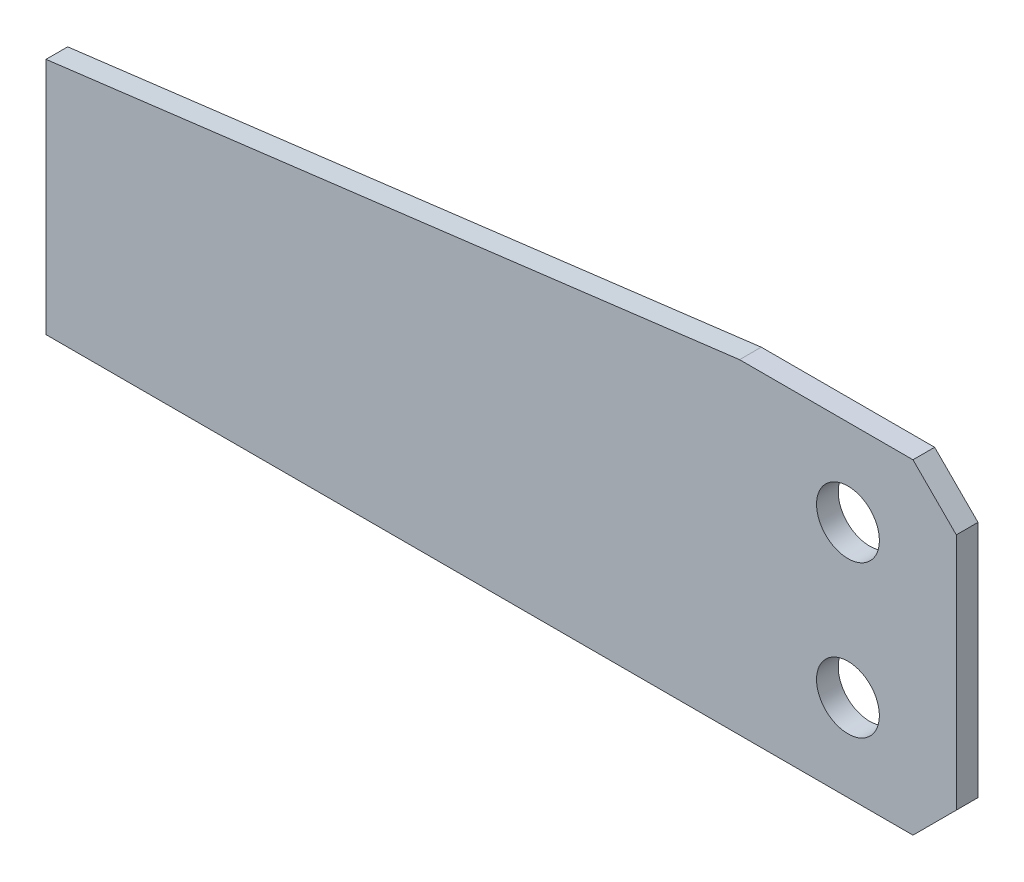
from build123d import *

# Parameters (mm, degrees)
ESQUISSE1_R          = 14.5
BASE_EXTRUSION_DEPTH = 10


with BuildPart() as part:
    # Esquisse1 → Base-Extrusion (new body)
    with BuildSketch(Plane.XY):
        Polygon((-100, 0), (-420, -40), (-420, -150), (-20, -150), (0, -130), (0, -20), (-20, 0), align=None)
        with Locations((-50, -40)):
            Circle(ESQUISSE1_R, mode=Mode.SUBTRACT)
        with Locations((-50, -110)):
            Circle(ESQUISSE1_R, mode=Mode.SUBTRACT)
    extrude(amount=BASE_EXTRUSION_DEPTH)


solid = part.part
